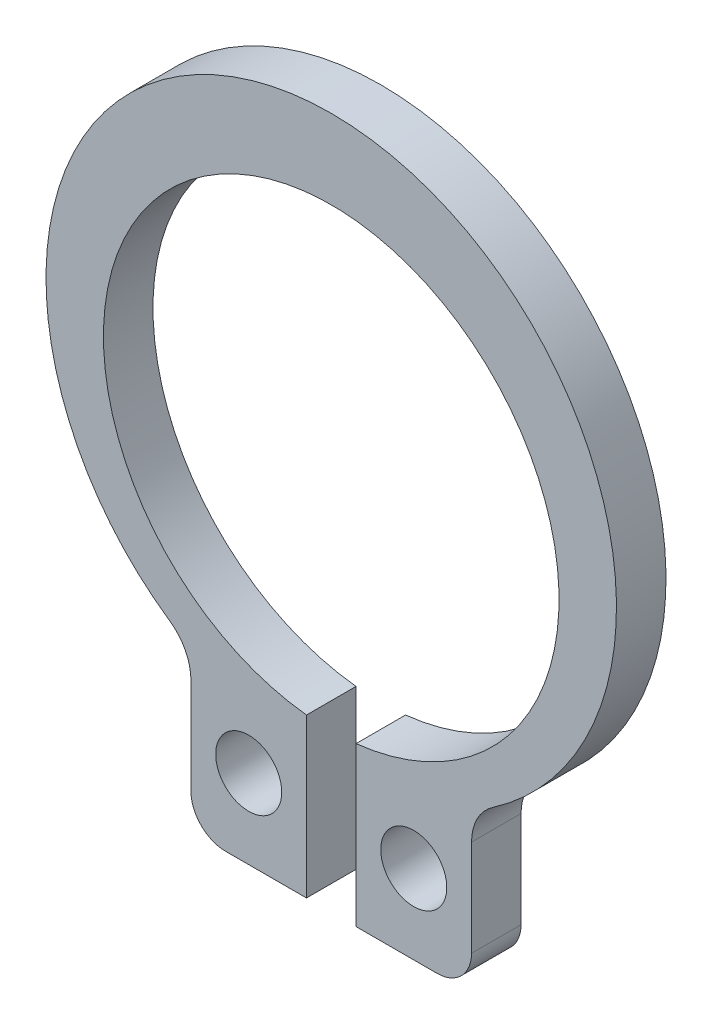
from build123d import *

# Parameters (mm, degrees)
BODYSKE_R      = 1
BASEBODY_DEPTH = 1.5
FILLET1_R      = 1.5
FILLET2_R      = 1.05


with BuildPart() as part:
    # BodySke → BaseBody (new body)
    with BuildSketch(Plane.XY):
        with BuildLine():
            Line((-0.75, -6.859118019), (-0.75, -11.659118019))
            Line((-0.75, -11.659118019), (-4.25, -11.659118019))
            Line((-4.25, -11.659118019), (-4.25, -6.862439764))
            ThreePointArc((-4.25, -6.862439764), (0, 9.3), (4.25, -6.862439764))
            Line((4.25, -6.862439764), (4.25, -11.659118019))
            Line((4.25, -11.659118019), (0.75, -11.659118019))
            Line((0.75, -11.659118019), (0.75, -6.859118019))
            ThreePointArc((0.75, -6.859118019), (0, 6.9), (-0.75, -6.859118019))
        make_face()
        with Locations((-2.5, -9.260778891)):
            Circle(BODYSKE_R, mode=Mode.SUBTRACT)
        with Locations(Location((2.5, -9.260778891, 0), (0, 0, 180))):
            Circle(BODYSKE_R, mode=Mode.SUBTRACT)
    extrude(amount=BASEBODY_DEPTH)

    # Fillet1
    fillet1_edges = [part.edges().sort_by_distance(p)[0] for p in [
        (-4.25, -6.862439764, 0.75),
        (4.25, -6.862439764, 0.75),
    ]]
    fillet(fillet1_edges, radius=FILLET1_R)

    # Fillet2
    fillet2_edges = [part.edges().sort_by_distance(p)[0] for p in [
        (-4.25, -11.659118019, 0.75),
        (4.25, -11.659118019, 0.75),
    ]]
    fillet(fillet2_edges, radius=FILLET2_R)


solid = part.part
